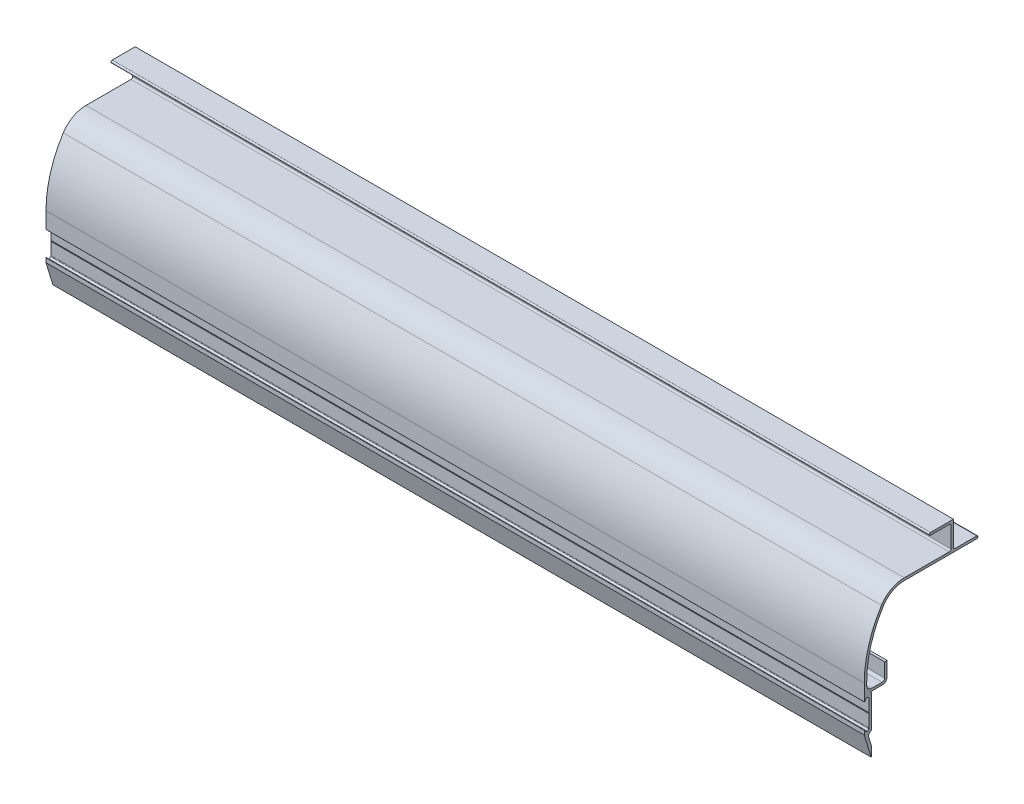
from build123d import *

# Parameters (mm, degrees)
EXTRUDE1_DEPTH = 500


with BuildPart() as part:
    # Sketch1 → Extrude1 (new, symmetric)
    with BuildSketch(Plane(origin=(0, 0, 0), x_dir=(0, 0, -1), z_dir=(1, 0, 0))):
        with BuildLine():
            Line((72, 201.470436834), (100, 201.470436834))
            Line((100, 201.470436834), (100, 171.470436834))
            ThreePointArc((100, 171.470436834), (100.585786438, 170.056223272), (102, 169.470436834))
            Line((102, 169.470436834), (128.5, 169.470436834))
            ThreePointArc((128.5, 169.470436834), (130, 167.970436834), (128.5, 166.470436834))
            Line((128.5, 166.470436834), (39.83349835, 166.470436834))
            ThreePointArc((39.83349835, 166.470436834), (25.44600378, 162.795329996), (14.583547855, 152.670436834))
            ThreePointArc((14.583547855, 152.670436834), (-0.748023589, 119.048170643), (-6, 82.470436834))
            Line((-6, 82.470436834), (-6, 78.470436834))
            ThreePointArc((-6, 78.470436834), (-4.242640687, 74.227796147), (0, 72.470436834))
            Line((0, 72.470436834), (13, 72.470436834))
            ThreePointArc((13, 72.470436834), (15.121320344, 73.349116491), (16, 75.470436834))
            Line((16, 75.470436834), (16, 92.470436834))
            Line((16, 92.470436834), (19, 92.470436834))
            Line((19, 92.470436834), (19, 75.470436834))
            ThreePointArc((19, 75.470436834), (17.242640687, 71.227796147), (13, 69.470436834))
            Line((13, 69.470436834), (-0.763663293, 69.470436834))
            ThreePointArc((-0.763663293, 69.470436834), (-1.254728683, 69.113656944), (-1.067158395, 68.536374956))
            Line((-1.067158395, 68.536374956), (0, 67.761038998))
            Line((0, 67.761038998), (0, 47.560326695))
            Line((0, 47.560326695), (0, 28.434993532))
            Line((0, 28.434993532), (-2.599307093, 26.546486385))
            ThreePointArc((-2.599307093, 26.546486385), (-3.680922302, 25.071349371), (-3.704865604, 23.242320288))
            Line((-3.704865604, 23.242320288), (0, 11.124250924))
            Line((0, 11.124250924), (0, 0))
            ThreePointArc((0, 0), (-0.255657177, -0.296704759), (-0.586891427, -0.087711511))
            Line((-0.586891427, -0.087711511), (-9, 27.430326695))
            Line((-9, 27.430326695), (-9, 32.450359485))
            ThreePointArc((-9, 32.450359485), (-8.785204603, 32.738005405), (-8.44839883, 32.613751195))
            Line((-8.44839883, 32.613751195), (-6.722690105, 29.956392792))
            ThreePointArc((-6.722690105, 29.956392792), (-6.066255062, 29.51777692), (-5.296234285, 29.692014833))
            Line((-5.296234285, 29.692014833), (-3.412214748, 31.06083515))
            ThreePointArc((-3.412214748, 31.06083515), (-3.108993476, 31.415861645), (-3, 31.869852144))
            Line((-3, 31.869852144), (-3, 47.060326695))
            Line((-3, 47.060326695), (-2.5, 47.560326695))
            Line((-2.5, 47.560326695), (-3, 48.060326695))
            Line((-3, 48.060326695), (-3, 63.250801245))
            ThreePointArc((-3, 63.250801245), (-3.108993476, 63.704791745), (-3.412214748, 64.05981824))
            Line((-3.412214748, 64.05981824), (-5.296234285, 65.428638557))
            ThreePointArc((-5.296234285, 65.428638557), (-6.066255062, 65.60287647), (-6.722690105, 65.164260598))
            Line((-6.722690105, 65.164260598), (-8.44839883, 62.506902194))
            ThreePointArc((-8.44839883, 62.506902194), (-8.785204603, 62.382647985), (-9, 62.670293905))
            Line((-9, 62.670293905), (-9, 82.470436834))
            ThreePointArc((-9, 82.470436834), (-3.626824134, 119.892272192), (12.058552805, 154.290436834))
            ThreePointArc((12.058552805, 154.290436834), (24.007254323, 165.427819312), (39.83349835, 169.470436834))
            Line((39.83349835, 169.470436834), (95, 169.470436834))
            ThreePointArc((95, 169.470436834), (96.414213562, 170.056223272), (97, 171.470436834))
            Line((97, 171.470436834), (97, 196.470436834))
            ThreePointArc((97, 196.470436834), (96.414213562, 197.884650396), (95, 198.470436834))
            Line((95, 198.470436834), (72, 198.470436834))
            ThreePointArc((72, 198.470436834), (70.5, 199.970436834), (72, 201.470436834))
        make_face()
    extrude(amount=EXTRUDE1_DEPTH, both=True)


solid = part.part
